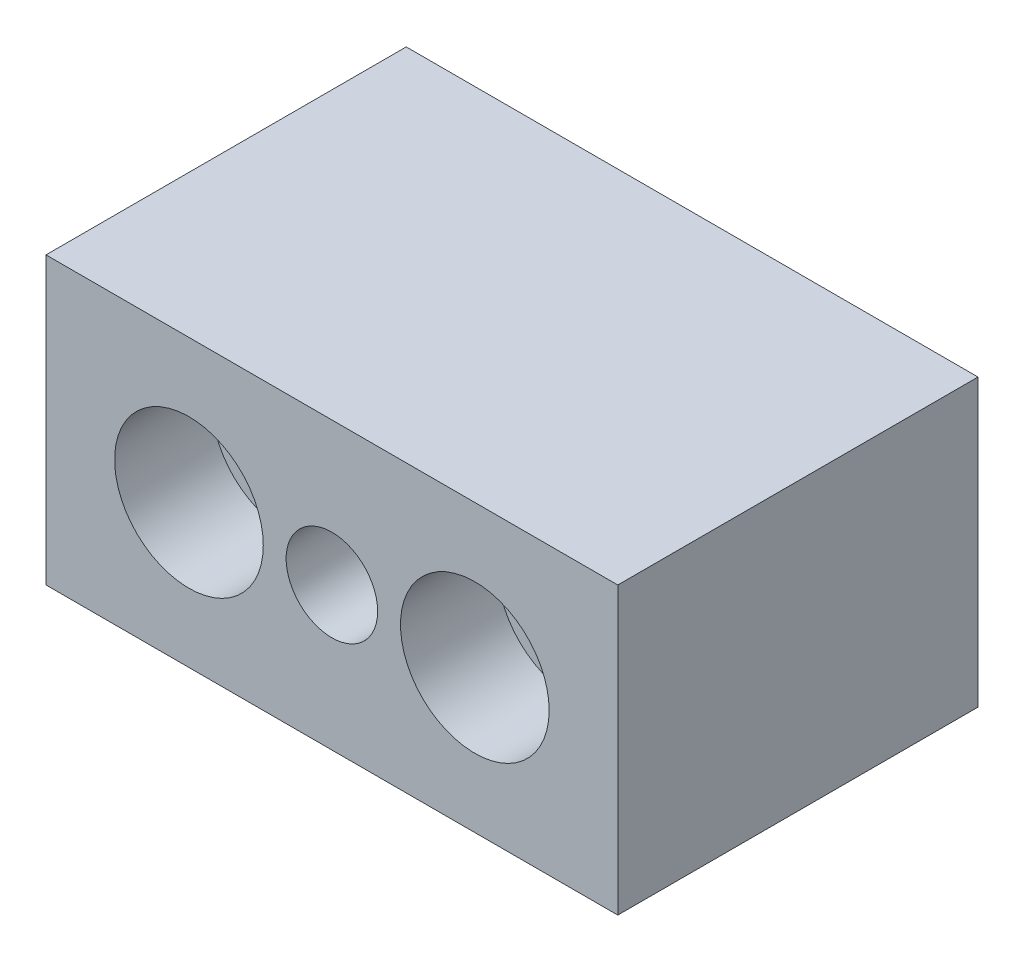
ISO-10303-21;
HEADER;
FILE_DESCRIPTION(('STEP AP214'),'2;1');
FILE_NAME('part.step','',(''),(''),'','','');
FILE_SCHEMA(('AUTOMOTIVE_DESIGN { 1 0 10303 214 1 1 1 1 }'));
ENDSEC;
DATA;
#1=APPLICATION_CONTEXT('core data for automotive mechanical design processes');
#2=APPLICATION_PROTOCOL_DEFINITION('international standard','automotive_design',2000,#1);
#3=PRODUCT_CONTEXT('',#1,'mechanical');
#4=PRODUCT('Part','Part','',(#3));
#5=PRODUCT_RELATED_PRODUCT_CATEGORY('part','',(#4));
#6=PRODUCT_DEFINITION_FORMATION('','',#4);
#7=PRODUCT_DEFINITION_CONTEXT('part definition',#1,'design');
#8=PRODUCT_DEFINITION('design','',#6,#7);
#9=PRODUCT_DEFINITION_SHAPE('','',#8);
#10=(LENGTH_UNIT() NAMED_UNIT(*) SI_UNIT(.MILLI.,.METRE.));
#11=(NAMED_UNIT(*) PLANE_ANGLE_UNIT() SI_UNIT($,.RADIAN.));
#12=(NAMED_UNIT(*) SI_UNIT($,.STERADIAN.) SOLID_ANGLE_UNIT());
#13=UNCERTAINTY_MEASURE_WITH_UNIT(LENGTH_MEASURE(1.E-05),#10,'distance_accuracy_value','');
#14=(GEOMETRIC_REPRESENTATION_CONTEXT(3) GLOBAL_UNCERTAINTY_ASSIGNED_CONTEXT((#13)) GLOBAL_UNIT_ASSIGNED_CONTEXT((#10,
#11,#12)) REPRESENTATION_CONTEXT('',''));
#15=CARTESIAN_POINT('',(0.,0.,0.));
#16=DIRECTION('',(0.,0.,1.));
#17=DIRECTION('',(1.,0.,0.));
#18=AXIS2_PLACEMENT_3D('',#15,#16,#17);
#19=CARTESIAN_POINT('',(-25.,25.,63.));
#20=DIRECTION('',(0.,0.,-1.));
#21=DIRECTION('',(-1.,0.,0.));
#22=AXIS2_PLACEMENT_3D('',#19,#20,#21);
#23=PLANE('',#22);
#24=CARTESIAN_POINT('',(25.,0.,63.));
#25=DIRECTION('',(0.,0.,1.));
#26=DIRECTION('',(1.,0.,0.));
#27=AXIS2_PLACEMENT_3D('',#24,#25,#26);
#28=CIRCLE('',#27,8.);
#29=CARTESIAN_POINT('',(33.,0.,63.));
#30=VERTEX_POINT('',#29);
#31=EDGE_CURVE('E147',#30,#30,#28,.T.);
#32=ORIENTED_EDGE('',*,*,#31,.F.);
#33=EDGE_LOOP('',(#32));
#34=FACE_BOUND('',#33,.T.);
#35=CARTESIAN_POINT('',(0.,0.,63.));
#36=DIRECTION('',(0.,0.,1.));
#37=DIRECTION('',(1.,0.,0.));
#38=AXIS2_PLACEMENT_3D('',#35,#36,#37);
#39=CIRCLE('',#38,13.);
#40=CARTESIAN_POINT('',(13.,0.,63.));
#41=VERTEX_POINT('',#40);
#42=EDGE_CURVE('E84',#41,#41,#39,.T.);
#43=ORIENTED_EDGE('',*,*,#42,.F.);
#44=EDGE_LOOP('',(#43));
#45=FACE_BOUND('',#44,.T.);
#46=DIRECTION('',(0.,1.,0.));
#47=VECTOR('',#46,1.);
#48=CARTESIAN_POINT('',(-25.,-25.,63.));
#49=LINE('',#48,#47);
#50=CARTESIAN_POINT('',(-25.,-25.,63.));
#51=VERTEX_POINT('',#50);
#52=CARTESIAN_POINT('',(-25.,25.,63.));
#53=VERTEX_POINT('',#52);
#54=EDGE_CURVE('E66',#51,#53,#49,.T.);
#55=ORIENTED_EDGE('',*,*,#54,.F.);
#56=DIRECTION('',(-1.,0.,0.));
#57=VECTOR('',#56,1.);
#58=CARTESIAN_POINT('',(75.,-25.,63.));
#59=LINE('',#58,#57);
#60=CARTESIAN_POINT('',(75.,-25.,63.));
#61=VERTEX_POINT('',#60);
#62=EDGE_CURVE('E48',#61,#51,#59,.T.);
#63=ORIENTED_EDGE('',*,*,#62,.F.);
#64=DIRECTION('',(0.,-1.,0.));
#65=VECTOR('',#64,1.);
#66=CARTESIAN_POINT('',(75.,25.,63.));
#67=LINE('',#66,#65);
#68=CARTESIAN_POINT('',(75.,25.,63.));
#69=VERTEX_POINT('',#68);
#70=EDGE_CURVE('E57',#69,#61,#67,.T.);
#71=ORIENTED_EDGE('',*,*,#70,.F.);
#72=DIRECTION('',(1.,0.,0.));
#73=VECTOR('',#72,1.);
#74=CARTESIAN_POINT('',(-25.,25.,63.));
#75=LINE('',#74,#73);
#76=EDGE_CURVE('E62',#53,#69,#75,.T.);
#77=ORIENTED_EDGE('',*,*,#76,.F.);
#78=EDGE_LOOP('',(#55,#63,#71,#77));
#79=FACE_BOUND('',#78,.T.);
#80=CARTESIAN_POINT('',(50.,0.,63.));
#81=DIRECTION('',(0.,0.,1.));
#82=DIRECTION('',(1.,0.,0.));
#83=AXIS2_PLACEMENT_3D('',#80,#81,#82);
#84=CIRCLE('',#83,13.);
#85=CARTESIAN_POINT('',(63.,0.,63.));
#86=VERTEX_POINT('',#85);
#87=EDGE_CURVE('E160',#86,#86,#84,.T.);
#88=ORIENTED_EDGE('',*,*,#87,.F.);
#89=EDGE_LOOP('',(#88));
#90=FACE_BOUND('',#89,.T.);
#91=ADVANCED_FACE('F14',(#34,#45,#79,#90),#23,.F.);
#92=CARTESIAN_POINT('',(-25.,25.,0.));
#93=DIRECTION('',(0.,0.,-1.));
#94=DIRECTION('',(-1.,0.,0.));
#95=AXIS2_PLACEMENT_3D('',#92,#93,#94);
#96=PLANE('',#95);
#97=CARTESIAN_POINT('',(0.,0.,0.));
#98=DIRECTION('',(0.,0.,1.));
#99=DIRECTION('',(1.,0.,0.));
#100=AXIS2_PLACEMENT_3D('',#97,#98,#99);
#101=CIRCLE('',#100,9.);
#102=CARTESIAN_POINT('',(9.,0.,0.));
#103=VERTEX_POINT('',#102);
#104=EDGE_CURVE('E163',#103,#103,#101,.T.);
#105=ORIENTED_EDGE('',*,*,#104,.T.);
#106=EDGE_LOOP('',(#105));
#107=FACE_BOUND('',#106,.T.);
#108=DIRECTION('',(0.,1.,0.));
#109=VECTOR('',#108,1.);
#110=CARTESIAN_POINT('',(-25.,-25.,0.));
#111=LINE('',#110,#109);
#112=CARTESIAN_POINT('',(-25.,-25.,0.));
#113=VERTEX_POINT('',#112);
#114=CARTESIAN_POINT('',(-25.,25.,0.));
#115=VERTEX_POINT('',#114);
#116=EDGE_CURVE('E67',#113,#115,#111,.T.);
#117=ORIENTED_EDGE('',*,*,#116,.T.);
#118=DIRECTION('',(1.,0.,0.));
#119=VECTOR('',#118,1.);
#120=CARTESIAN_POINT('',(-25.,25.,0.));
#121=LINE('',#120,#119);
#122=CARTESIAN_POINT('',(75.,25.,0.));
#123=VERTEX_POINT('',#122);
#124=EDGE_CURVE('E70',#115,#123,#121,.T.);
#125=ORIENTED_EDGE('',*,*,#124,.T.);
#126=DIRECTION('',(0.,-1.,0.));
#127=VECTOR('',#126,1.);
#128=CARTESIAN_POINT('',(75.,25.,0.));
#129=LINE('',#128,#127);
#130=CARTESIAN_POINT('',(75.,-25.,0.));
#131=VERTEX_POINT('',#130);
#132=EDGE_CURVE('E80',#123,#131,#129,.T.);
#133=ORIENTED_EDGE('',*,*,#132,.T.);
#134=DIRECTION('',(-1.,0.,0.));
#135=VECTOR('',#134,1.);
#136=CARTESIAN_POINT('',(75.,-25.,0.));
#137=LINE('',#136,#135);
#138=EDGE_CURVE('E51',#131,#113,#137,.T.);
#139=ORIENTED_EDGE('',*,*,#138,.T.);
#140=EDGE_LOOP('',(#117,#125,#133,#139));
#141=FACE_BOUND('',#140,.T.);
#142=CARTESIAN_POINT('',(50.,0.,0.));
#143=DIRECTION('',(0.,0.,1.));
#144=DIRECTION('',(1.,0.,0.));
#145=AXIS2_PLACEMENT_3D('',#142,#143,#144);
#146=CIRCLE('',#145,9.);
#147=CARTESIAN_POINT('',(59.,0.,0.));
#148=VERTEX_POINT('',#147);
#149=EDGE_CURVE('E146',#148,#148,#146,.T.);
#150=ORIENTED_EDGE('',*,*,#149,.T.);
#151=EDGE_LOOP('',(#150));
#152=FACE_BOUND('',#151,.T.);
#153=ADVANCED_FACE('F78',(#107,#141,#152),#96,.T.);
#154=CARTESIAN_POINT('',(-25.,-25.,63.));
#155=DIRECTION('',(-1.,0.,0.));
#156=DIRECTION('',(0.,0.,1.));
#157=AXIS2_PLACEMENT_3D('',#154,#155,#156);
#158=PLANE('',#157);
#159=DIRECTION('',(0.,0.,-1.));
#160=VECTOR('',#159,1.);
#161=CARTESIAN_POINT('',(-25.,-25.,63.));
#162=LINE('',#161,#160);
#163=EDGE_CURVE('E9',#51,#113,#162,.T.);
#164=ORIENTED_EDGE('',*,*,#163,.F.);
#165=ORIENTED_EDGE('',*,*,#54,.T.);
#166=DIRECTION('',(0.,0.,-1.));
#167=VECTOR('',#166,1.);
#168=CARTESIAN_POINT('',(-25.,25.,63.));
#169=LINE('',#168,#167);
#170=EDGE_CURVE('E30',#53,#115,#169,.T.);
#171=ORIENTED_EDGE('',*,*,#170,.T.);
#172=ORIENTED_EDGE('',*,*,#116,.F.);
#173=EDGE_LOOP('',(#164,#165,#171,#172));
#174=FACE_BOUND('',#173,.T.);
#175=ADVANCED_FACE('F88',(#174),#158,.T.);
#176=CARTESIAN_POINT('',(75.,-25.,63.));
#177=DIRECTION('',(0.,-1.,0.));
#178=DIRECTION('',(1.,0.,0.));
#179=AXIS2_PLACEMENT_3D('',#176,#177,#178);
#180=PLANE('',#179);
#181=DIRECTION('',(0.,0.,-1.));
#182=VECTOR('',#181,1.);
#183=CARTESIAN_POINT('',(75.,-25.,63.));
#184=LINE('',#183,#182);
#185=EDGE_CURVE('E23',#61,#131,#184,.T.);
#186=ORIENTED_EDGE('',*,*,#185,.F.);
#187=ORIENTED_EDGE('',*,*,#62,.T.);
#188=ORIENTED_EDGE('',*,*,#163,.T.);
#189=ORIENTED_EDGE('',*,*,#138,.F.);
#190=EDGE_LOOP('',(#186,#187,#188,#189));
#191=FACE_BOUND('',#190,.T.);
#192=ADVANCED_FACE('F16',(#191),#180,.T.);
#193=CARTESIAN_POINT('',(75.,25.,63.));
#194=DIRECTION('',(1.,0.,0.));
#195=DIRECTION('',(0.,1.,0.));
#196=AXIS2_PLACEMENT_3D('',#193,#194,#195);
#197=PLANE('',#196);
#198=DIRECTION('',(0.,0.,-1.));
#199=VECTOR('',#198,1.);
#200=CARTESIAN_POINT('',(75.,25.,63.));
#201=LINE('',#200,#199);
#202=EDGE_CURVE('E55',#69,#123,#201,.T.);
#203=ORIENTED_EDGE('',*,*,#202,.F.);
#204=ORIENTED_EDGE('',*,*,#70,.T.);
#205=ORIENTED_EDGE('',*,*,#185,.T.);
#206=ORIENTED_EDGE('',*,*,#132,.F.);
#207=EDGE_LOOP('',(#203,#204,#205,#206));
#208=FACE_BOUND('',#207,.T.);
#209=ADVANCED_FACE('F58',(#208),#197,.T.);
#210=CARTESIAN_POINT('',(-25.,25.,63.));
#211=DIRECTION('',(0.,1.,0.));
#212=DIRECTION('',(0.,0.,1.));
#213=AXIS2_PLACEMENT_3D('',#210,#211,#212);
#214=PLANE('',#213);
#215=ORIENTED_EDGE('',*,*,#76,.T.);
#216=ORIENTED_EDGE('',*,*,#202,.T.);
#217=ORIENTED_EDGE('',*,*,#124,.F.);
#218=ORIENTED_EDGE('',*,*,#170,.F.);
#219=EDGE_LOOP('',(#215,#216,#217,#218));
#220=FACE_BOUND('',#219,.T.);
#221=ADVANCED_FACE('F76',(#220),#214,.T.);
#222=CARTESIAN_POINT('',(0.,0.,63.));
#223=DIRECTION('',(0.,0.,1.));
#224=DIRECTION('',(1.,0.,0.));
#225=AXIS2_PLACEMENT_3D('',#222,#223,#224);
#226=CYLINDRICAL_SURFACE('',#225,13.);
#227=ORIENTED_EDGE('',*,*,#42,.T.);
#228=EDGE_LOOP('',(#227));
#229=FACE_BOUND('',#228,.T.);
#230=CARTESIAN_POINT('',(0.,0.,46.));
#231=DIRECTION('',(0.,0.,1.));
#232=DIRECTION('',(1.,0.,0.));
#233=AXIS2_PLACEMENT_3D('',#230,#231,#232);
#234=CIRCLE('',#233,13.);
#235=CARTESIAN_POINT('',(13.,0.,46.));
#236=VERTEX_POINT('',#235);
#237=EDGE_CURVE('E169',#236,#236,#234,.T.);
#238=ORIENTED_EDGE('',*,*,#237,.F.);
#239=EDGE_LOOP('',(#238));
#240=FACE_BOUND('',#239,.T.);
#241=ADVANCED_FACE('F110',(#229,#240),#226,.F.);
#242=CARTESIAN_POINT('',(9.,0.,46.));
#243=DIRECTION('',(0.,0.,1.));
#244=DIRECTION('',(1.,0.,0.));
#245=AXIS2_PLACEMENT_3D('',#242,#243,#244);
#246=PLANE('',#245);
#247=ORIENTED_EDGE('',*,*,#237,.T.);
#248=EDGE_LOOP('',(#247));
#249=FACE_BOUND('',#248,.T.);
#250=CARTESIAN_POINT('',(0.,0.,46.));
#251=DIRECTION('',(0.,0.,1.));
#252=DIRECTION('',(1.,0.,0.));
#253=AXIS2_PLACEMENT_3D('',#250,#251,#252);
#254=CIRCLE('',#253,9.);
#255=CARTESIAN_POINT('',(9.,0.,46.));
#256=VERTEX_POINT('',#255);
#257=EDGE_CURVE('E166',#256,#256,#254,.T.);
#258=ORIENTED_EDGE('',*,*,#257,.F.);
#259=EDGE_LOOP('',(#258));
#260=FACE_BOUND('',#259,.T.);
#261=ADVANCED_FACE('F113',(#249,#260),#246,.T.);
#262=CARTESIAN_POINT('',(0.,0.,63.));
#263=DIRECTION('',(0.,0.,1.));
#264=DIRECTION('',(1.,0.,0.));
#265=AXIS2_PLACEMENT_3D('',#262,#263,#264);
#266=CYLINDRICAL_SURFACE('',#265,9.);
#267=ORIENTED_EDGE('',*,*,#257,.T.);
#268=EDGE_LOOP('',(#267));
#269=FACE_BOUND('',#268,.T.);
#270=ORIENTED_EDGE('',*,*,#104,.F.);
#271=EDGE_LOOP('',(#270));
#272=FACE_BOUND('',#271,.T.);
#273=ADVANCED_FACE('F117',(#269,#272),#266,.F.);
#274=CARTESIAN_POINT('',(50.,0.,63.));
#275=DIRECTION('',(0.,0.,1.));
#276=DIRECTION('',(1.,0.,0.));
#277=AXIS2_PLACEMENT_3D('',#274,#275,#276);
#278=CYLINDRICAL_SURFACE('',#277,13.);
#279=ORIENTED_EDGE('',*,*,#87,.T.);
#280=EDGE_LOOP('',(#279));
#281=FACE_BOUND('',#280,.T.);
#282=CARTESIAN_POINT('',(50.,0.,46.));
#283=DIRECTION('',(0.,0.,1.));
#284=DIRECTION('',(1.,0.,0.));
#285=AXIS2_PLACEMENT_3D('',#282,#283,#284);
#286=CIRCLE('',#285,13.);
#287=CARTESIAN_POINT('',(63.,0.,46.));
#288=VERTEX_POINT('',#287);
#289=EDGE_CURVE('E157',#288,#288,#286,.T.);
#290=ORIENTED_EDGE('',*,*,#289,.F.);
#291=EDGE_LOOP('',(#290));
#292=FACE_BOUND('',#291,.T.);
#293=ADVANCED_FACE('F121',(#281,#292),#278,.F.);
#294=CARTESIAN_POINT('',(59.,0.,46.));
#295=DIRECTION('',(0.,0.,1.));
#296=DIRECTION('',(1.,0.,0.));
#297=AXIS2_PLACEMENT_3D('',#294,#295,#296);
#298=PLANE('',#297);
#299=ORIENTED_EDGE('',*,*,#289,.T.);
#300=EDGE_LOOP('',(#299));
#301=FACE_BOUND('',#300,.T.);
#302=CARTESIAN_POINT('',(50.,0.,46.));
#303=DIRECTION('',(0.,0.,1.));
#304=DIRECTION('',(1.,0.,0.));
#305=AXIS2_PLACEMENT_3D('',#302,#303,#304);
#306=CIRCLE('',#305,9.);
#307=CARTESIAN_POINT('',(59.,0.,46.));
#308=VERTEX_POINT('',#307);
#309=EDGE_CURVE('E150',#308,#308,#306,.T.);
#310=ORIENTED_EDGE('',*,*,#309,.F.);
#311=EDGE_LOOP('',(#310));
#312=FACE_BOUND('',#311,.T.);
#313=ADVANCED_FACE('F125',(#301,#312),#298,.T.);
#314=CARTESIAN_POINT('',(50.,0.,63.));
#315=DIRECTION('',(0.,0.,1.));
#316=DIRECTION('',(1.,0.,0.));
#317=AXIS2_PLACEMENT_3D('',#314,#315,#316);
#318=CYLINDRICAL_SURFACE('',#317,9.);
#319=ORIENTED_EDGE('',*,*,#309,.T.);
#320=EDGE_LOOP('',(#319));
#321=FACE_BOUND('',#320,.T.);
#322=ORIENTED_EDGE('',*,*,#149,.F.);
#323=EDGE_LOOP('',(#322));
#324=FACE_BOUND('',#323,.T.);
#325=ADVANCED_FACE('F129',(#321,#324),#318,.F.);
#326=CARTESIAN_POINT('',(25.,0.,28.));
#327=DIRECTION('',(0.,0.,1.));
#328=DIRECTION('',(1.,0.,0.));
#329=AXIS2_PLACEMENT_3D('',#326,#327,#328);
#330=CYLINDRICAL_SURFACE('',#329,8.);
#331=CARTESIAN_POINT('',(25.,0.,28.));
#332=DIRECTION('',(0.,0.,1.));
#333=DIRECTION('',(1.,0.,0.));
#334=AXIS2_PLACEMENT_3D('',#331,#332,#333);
#335=CIRCLE('',#334,8.);
#336=CARTESIAN_POINT('',(33.,0.,28.));
#337=VERTEX_POINT('',#336);
#338=EDGE_CURVE('E145',#337,#337,#335,.T.);
#339=ORIENTED_EDGE('',*,*,#338,.F.);
#340=EDGE_LOOP('',(#339));
#341=FACE_BOUND('',#340,.T.);
#342=ORIENTED_EDGE('',*,*,#31,.T.);
#343=EDGE_LOOP('',(#342));
#344=FACE_BOUND('',#343,.T.);
#345=ADVANCED_FACE('F133',(#341,#344),#330,.F.);
#346=CARTESIAN_POINT('',(25.,0.,28.));
#347=DIRECTION('',(0.,0.,1.));
#348=DIRECTION('',(1.,0.,0.));
#349=AXIS2_PLACEMENT_3D('',#346,#347,#348);
#350=PLANE('',#349);
#351=ORIENTED_EDGE('',*,*,#338,.T.);
#352=EDGE_LOOP('',(#351));
#353=FACE_BOUND('',#352,.T.);
#354=ADVANCED_FACE('F135',(#353),#350,.T.);
#355=CLOSED_SHELL('',(#91,#153,#175,#192,#209,#221,#241,#261,#273,#293,#313,#325,#345,#354));
#356=MANIFOLD_SOLID_BREP('B1',#355);
#357=ADVANCED_BREP_SHAPE_REPRESENTATION('',(#18,#356),#14);
#358=SHAPE_DEFINITION_REPRESENTATION(#9,#357);
ENDSEC;
END-ISO-10303-21;
